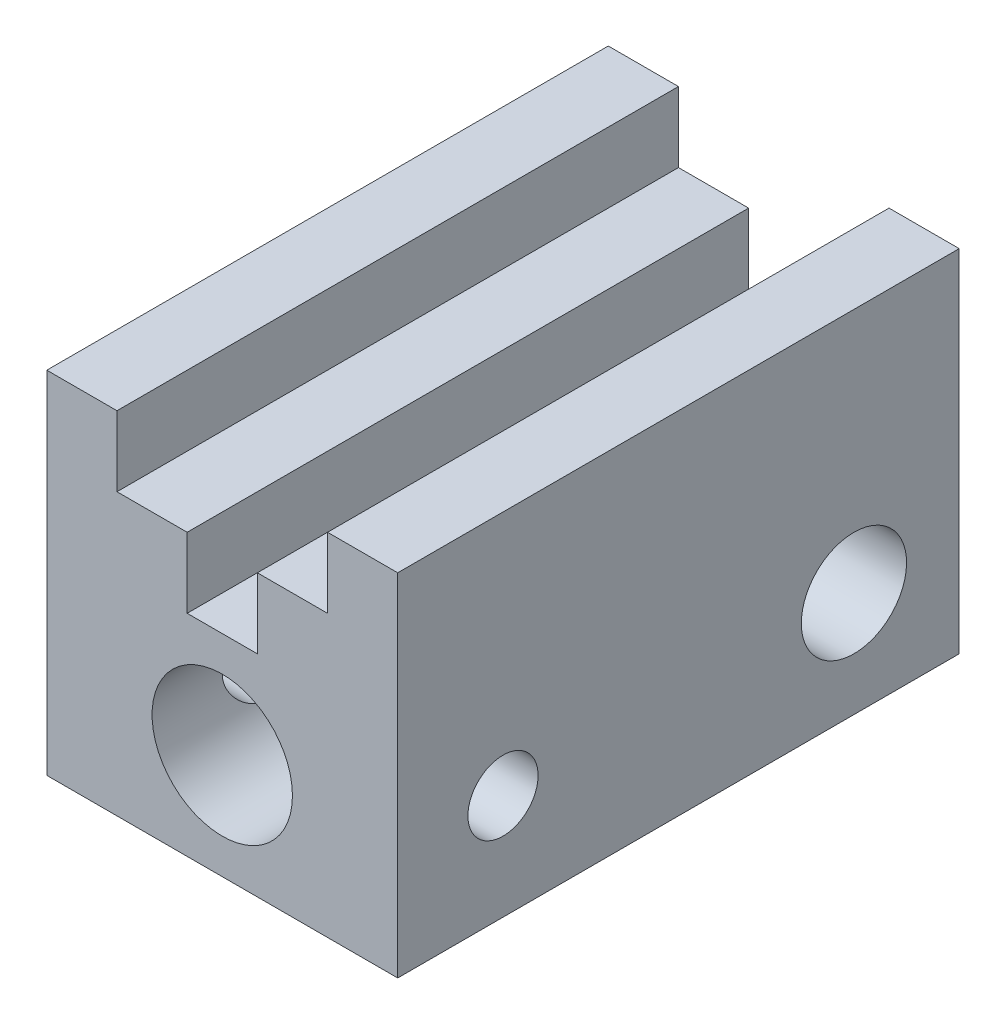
from build123d import *

# Parameters (mm, degrees)
SKETCH_1_R          = 10
EXTRUDE_1_DEPTH     = 80
SKETCH_2_R          = 5
SKETCH_2_R_2        = 7.5
CUT_EXTRUDE_1_DEPTH = 107.77078252


with BuildPart() as part:
    # Sketch 1 → Extrude 1 (new body)
    with BuildSketch(Plane.XY):
        Polygon((-15, 50), (-15, 40), (-5, 40), (-5, 30), (5, 30), (5, 40), (15, 40), (15, 50), (25, 50), (25, 0), (-25, 0), (-25, 50), align=None)
        with Locations((0, 15)):
            Circle(SKETCH_1_R, mode=Mode.SUBTRACT)
    extrude(amount=-EXTRUDE_1_DEPTH)

    # Sketch 2 → Cut-Extrude 1 (cut, through all)
    with BuildSketch(Plane(origin=(25, 0, 0), x_dir=(0, 0, -1), z_dir=(1, 0, 0))):
        with Locations(Location((15, 15, 0), (0, 0, 90))):
            Circle(SKETCH_2_R)
        with Locations(Location((65, 15, 0), (0, 0, 90))):
            Circle(SKETCH_2_R_2)
    extrude(amount=-CUT_EXTRUDE_1_DEPTH, mode=Mode.SUBTRACT)


solid = part.part
